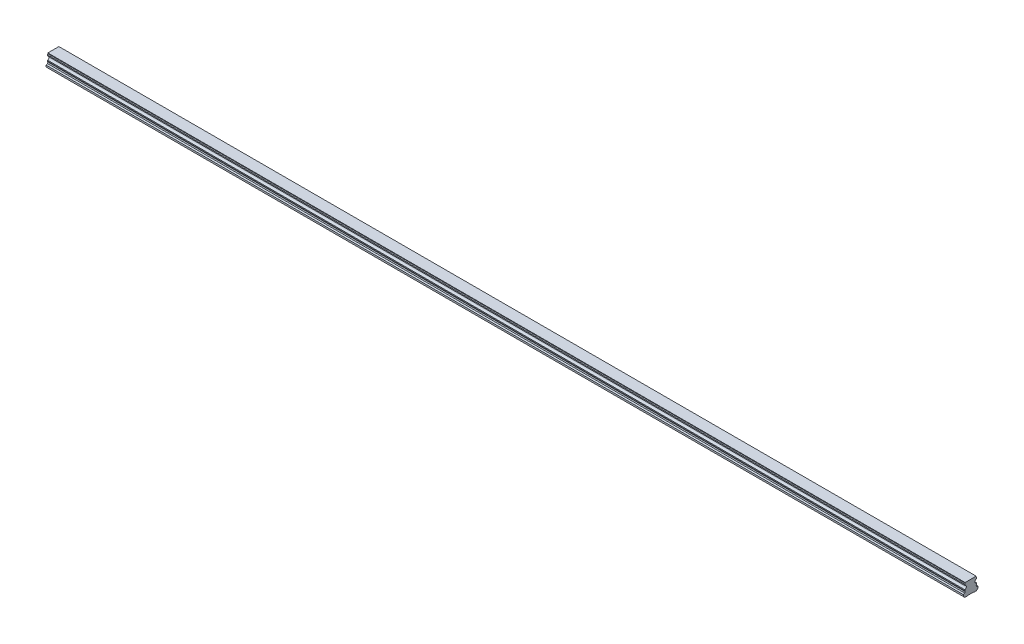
from build123d import *

# Parameters (mm, degrees)
BOSS_EXTRUDE1_DEPTH        = 1560
SKETCH3_R                  = 3
SKETCH3_R_2                = 2.5
CUT_EXTRUDE3_DEPTH         = 12
SKETCH3_2_R                = 2.5
CUT_EXTRUDE4_DEPTH         = 15
CHAMFER1_SIZE              = 0.5
LPATTERN4_COUNT            = 26
LPATTERN4_PITCH            = 60
CHAMFER1_OF_LPATTERN4_SIZE = 0.5


with BuildPart() as part:
    # Sketch1 → Boss-Extrude1 (new body)
    with BuildSketch(Plane(origin=(0, 0, 0), x_dir=(0, 0, -1), z_dir=(1, 0, 0))):
        with BuildLine():
            Line((9.375, 21.8), (-9.375, 21.8))
            Line((-9.375, 21.8), (-9.375, 20.756))
            Line((-9.375, 20.756), (-10, 19.415683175))
            Line((-10, 19.415683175), (-10, 17.685449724))
            ThreePointArc((-10, 17.685449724), (-7.2, 14.6), (-10, 11.514550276))
            Line((-10, 11.514550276), (-10, 9.784316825))
            Line((-10, 9.784316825), (-9.375, 8.444))
            Line((-9.375, 8.444), (-9.922688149, 6.4))
            Line((-9.922688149, 6.4), (-12.5, 5.489338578))
            Line((-12.5, 5.489338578), (-12.5, 2.65))
            Line((-12.5, 2.65), (-9.85, 0))
            Line((-9.85, 0), (-5.5, 0))
            Line((-5.5, 0), (-5, 0.5))
            Line((-5, 0.5), (5, 0.5))
            Line((5, 0.5), (5.5, 0))
            Line((5.5, 0), (9.85, 0))
            Line((9.85, 0), (12.5, 2.65))
            Line((12.5, 2.65), (12.5, 5.489338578))
            Line((12.5, 5.489338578), (9.922688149, 6.4))
            Line((9.922688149, 6.4), (9.375, 8.444))
            Line((9.375, 8.444), (10, 9.784316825))
            Line((10, 9.784316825), (10, 11.514550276))
            ThreePointArc((10, 11.514550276), (7.2, 14.6), (10, 17.685449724))
            Line((10, 17.685449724), (10, 19.415683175))
            Line((10, 19.415683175), (9.375, 20.756))
            Line((9.375, 20.756), (9.375, 21.8))
        make_face()
    extrude(amount=BOSS_EXTRUDE1_DEPTH)

    # Sketch3 → Cut-Extrude3 (cut)
    with BuildSketch(Plane.XZ):
        with Locations(Location((30, 0, 0), (0, 0, 270))):
            Circle(SKETCH3_R)
        with Locations(Location((30, 0, 0), (0, 0, 270))):
            Circle(SKETCH3_R_2, mode=Mode.SUBTRACT)
    cut_extrude3 = extrude(amount=-CUT_EXTRUDE3_DEPTH, mode=Mode.SUBTRACT)

    # Sketch3_2 → Cut-Extrude4 (cut)
    with BuildSketch(Plane.XZ):
        with Locations(Location((30, 0, 0), (0, 0, 270))):
            Circle(SKETCH3_2_R)
    cut_extrude4 = extrude(amount=-CUT_EXTRUDE4_DEPTH, mode=Mode.SUBTRACT)

    # Cut-Extrude5 cone 1 section (on through the dimple's axis) → Cut-Extrude5 (revolve, cut)
    with BuildSketch(Plane(origin=(30, 15, 0), x_dir=(0, 0, -1), z_dir=(1, 0, 0))):
        Polygon((0, 0), (2.5, 0), (0, 1.443375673), align=None)
    cut_extrude5 = revolve(axis=Axis((30, 15, 0), (0, 1, 0)), mode=Mode.SUBTRACT)

    # Chamfer1
    chamfer1_edges = [part.edges().sort_by_distance(p)[0] for p in [
        (30, 0.5, 3),
    ]]
    chamfer(chamfer1_edges, length=CHAMFER1_SIZE)

    # LPattern4: Cut-Extrude3, Cut-Extrude4, Cut-Extrude5 ×26
    with Locations(*[(i * LPATTERN4_PITCH, 0, 0) for i in range(1, LPATTERN4_COUNT)]):
        add(cut_extrude3, mode=Mode.SUBTRACT)
        add(cut_extrude4, mode=Mode.SUBTRACT)
        add(cut_extrude5, mode=Mode.SUBTRACT)

    # Chamfer1 of LPattern4
    chamfer1_of_lpattern4_edges = [part.edges().sort_by_distance(p)[0] for p in [
        (90, 0.5, 3),
        (150, 0.5, 3),
        (210, 0.5, 3),
        (270, 0.5, 3),
        (330, 0.5, 3),
        (390, 0.5, 3),
        (450, 0.5, 3),
        (510, 0.5, 3),
        (570, 0.5, 3),
        (630, 0.5, 3),
        (690, 0.5, 3),
        (750, 0.5, 3),
        (810, 0.5, 3),
        (870, 0.5, 3),
        (930, 0.5, 3),
        (990, 0.5, 3),
        (1050, 0.5, 3),
        (1110, 0.5, 3),
        (1170, 0.5, 3),
        (1230, 0.5, 3),
        (1290, 0.5, 3),
        (1350, 0.5, 3),
        (1410, 0.5, 3),
        (1470, 0.5, 3),
        (1530, 0.5, 3),
    ]]
    chamfer(chamfer1_of_lpattern4_edges, length=CHAMFER1_OF_LPATTERN4_SIZE)


solid = part.part
